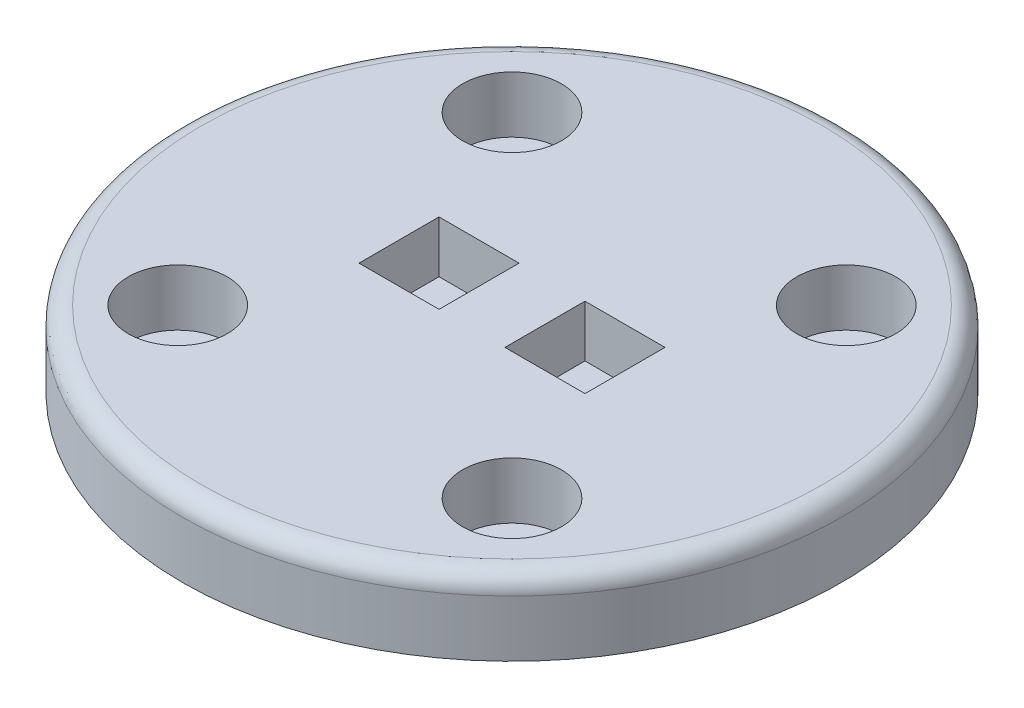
ISO-10303-21;
HEADER;
FILE_DESCRIPTION(('STEP AP214'),'2;1');
FILE_NAME('part.step','',(''),(''),'','','');
FILE_SCHEMA(('AUTOMOTIVE_DESIGN { 1 0 10303 214 1 1 1 1 }'));
ENDSEC;
DATA;
#1=APPLICATION_CONTEXT('core data for automotive mechanical design processes');
#2=APPLICATION_PROTOCOL_DEFINITION('international standard','automotive_design',2000,#1);
#3=PRODUCT_CONTEXT('',#1,'mechanical');
#4=PRODUCT('Part','Part','',(#3));
#5=PRODUCT_RELATED_PRODUCT_CATEGORY('part','',(#4));
#6=PRODUCT_DEFINITION_FORMATION('','',#4);
#7=PRODUCT_DEFINITION_CONTEXT('part definition',#1,'design');
#8=PRODUCT_DEFINITION('design','',#6,#7);
#9=PRODUCT_DEFINITION_SHAPE('','',#8);
#10=(LENGTH_UNIT() NAMED_UNIT(*) SI_UNIT(.MILLI.,.METRE.));
#11=(NAMED_UNIT(*) PLANE_ANGLE_UNIT() SI_UNIT($,.RADIAN.));
#12=(NAMED_UNIT(*) SI_UNIT($,.STERADIAN.) SOLID_ANGLE_UNIT());
#13=UNCERTAINTY_MEASURE_WITH_UNIT(LENGTH_MEASURE(1.E-05),#10,'distance_accuracy_value','');
#14=(GEOMETRIC_REPRESENTATION_CONTEXT(3) GLOBAL_UNCERTAINTY_ASSIGNED_CONTEXT((#13)) GLOBAL_UNIT_ASSIGNED_CONTEXT((#10,
#11,#12)) REPRESENTATION_CONTEXT('',''));
#15=CARTESIAN_POINT('',(0.,0.,0.));
#16=DIRECTION('',(0.,0.,1.));
#17=DIRECTION('',(1.,0.,0.));
#18=AXIS2_PLACEMENT_3D('',#15,#16,#17);
#19=CARTESIAN_POINT('',(0.,8.,0.));
#20=DIRECTION('',(0.,-1.,0.));
#21=DIRECTION('',(0.,0.,-1.));
#22=AXIS2_PLACEMENT_3D('',#19,#20,#21);
#23=CYLINDRICAL_SURFACE('',#22,35.);
#24=CARTESIAN_POINT('',(0.,6.,0.));
#25=DIRECTION('',(0.,1.,0.));
#26=DIRECTION('',(0.,0.,1.));
#27=AXIS2_PLACEMENT_3D('',#24,#25,#26);
#28=CIRCLE('',#27,35.);
#29=CARTESIAN_POINT('',(0.,6.,35.));
#30=VERTEX_POINT('',#29);
#31=EDGE_CURVE('E11',#30,#30,#28,.F.);
#32=ORIENTED_EDGE('',*,*,#31,.T.);
#33=EDGE_LOOP('',(#32));
#34=FACE_BOUND('',#33,.T.);
#35=CARTESIAN_POINT('',(0.,0.,0.));
#36=DIRECTION('',(0.,1.,0.));
#37=DIRECTION('',(0.,0.,1.));
#38=AXIS2_PLACEMENT_3D('',#35,#36,#37);
#39=CIRCLE('',#38,35.);
#40=CARTESIAN_POINT('',(0.,0.,35.));
#41=VERTEX_POINT('',#40);
#42=EDGE_CURVE('E214',#41,#41,#39,.T.);
#43=ORIENTED_EDGE('',*,*,#42,.T.);
#44=EDGE_LOOP('',(#43));
#45=FACE_BOUND('',#44,.T.);
#46=ADVANCED_FACE('F35',(#34,#45),#23,.T.);
#47=CARTESIAN_POINT('',(0.,8.,0.));
#48=DIRECTION('',(0.,1.,0.));
#49=DIRECTION('',(0.,0.,1.));
#50=AXIS2_PLACEMENT_3D('',#47,#48,#49);
#51=PLANE('',#50);
#52=CARTESIAN_POINT('',(0.,8.,0.));
#53=DIRECTION('',(0.,1.,0.));
#54=DIRECTION('',(0.,0.,1.));
#55=AXIS2_PLACEMENT_3D('',#52,#53,#54);
#56=CIRCLE('',#55,33.);
#57=CARTESIAN_POINT('',(0.,8.,33.));
#58=VERTEX_POINT('',#57);
#59=EDGE_CURVE('E43',#58,#58,#56,.T.);
#60=ORIENTED_EDGE('',*,*,#59,.T.);
#61=EDGE_LOOP('',(#60));
#62=FACE_BOUND('',#61,.T.);
#63=DIRECTION('',(-1.,0.,0.));
#64=VECTOR('',#63,1.);
#65=CARTESIAN_POINT('',(12.,8.,-4.25));
#66=LINE('',#65,#64);
#67=CARTESIAN_POINT('',(12.,8.,-4.25));
#68=VERTEX_POINT('',#67);
#69=CARTESIAN_POINT('',(3.5,8.,-4.25));
#70=VERTEX_POINT('',#69);
#71=EDGE_CURVE('E50',#68,#70,#66,.T.);
#72=ORIENTED_EDGE('',*,*,#71,.F.);
#73=DIRECTION('',(0.,0.,-1.));
#74=VECTOR('',#73,1.);
#75=CARTESIAN_POINT('',(12.,8.,-4.25));
#76=LINE('',#75,#74);
#77=CARTESIAN_POINT('',(12.,8.,4.25));
#78=VERTEX_POINT('',#77);
#79=EDGE_CURVE('E120',#78,#68,#76,.T.);
#80=ORIENTED_EDGE('',*,*,#79,.F.);
#81=DIRECTION('',(1.,0.,0.));
#82=VECTOR('',#81,1.);
#83=CARTESIAN_POINT('',(12.,8.,4.25));
#84=LINE('',#83,#82);
#85=CARTESIAN_POINT('',(3.5,8.,4.25));
#86=VERTEX_POINT('',#85);
#87=EDGE_CURVE('E123',#86,#78,#84,.T.);
#88=ORIENTED_EDGE('',*,*,#87,.F.);
#89=DIRECTION('',(0.,0.,1.));
#90=VECTOR('',#89,1.);
#91=CARTESIAN_POINT('',(3.5,8.,-4.25));
#92=LINE('',#91,#90);
#93=EDGE_CURVE('E129',#70,#86,#92,.T.);
#94=ORIENTED_EDGE('',*,*,#93,.F.);
#95=EDGE_LOOP('',(#72,#80,#88,#94));
#96=FACE_BOUND('',#95,.T.);
#97=DIRECTION('',(0.,0.,1.));
#98=VECTOR('',#97,1.);
#99=CARTESIAN_POINT('',(-12.,8.,-4.25));
#100=LINE('',#99,#98);
#101=CARTESIAN_POINT('',(-12.,8.,-4.25));
#102=VERTEX_POINT('',#101);
#103=CARTESIAN_POINT('',(-12.,8.,4.25));
#104=VERTEX_POINT('',#103);
#105=EDGE_CURVE('E58',#102,#104,#100,.T.);
#106=ORIENTED_EDGE('',*,*,#105,.F.);
#107=DIRECTION('',(-1.,0.,0.));
#108=VECTOR('',#107,1.);
#109=CARTESIAN_POINT('',(-12.,8.,-4.25));
#110=LINE('',#109,#108);
#111=CARTESIAN_POINT('',(-3.5,8.,-4.25));
#112=VERTEX_POINT('',#111);
#113=EDGE_CURVE('E142',#112,#102,#110,.T.);
#114=ORIENTED_EDGE('',*,*,#113,.F.);
#115=DIRECTION('',(0.,0.,-1.));
#116=VECTOR('',#115,1.);
#117=CARTESIAN_POINT('',(-3.5,8.,-4.25));
#118=LINE('',#117,#116);
#119=CARTESIAN_POINT('',(-3.5,8.,4.25));
#120=VERTEX_POINT('',#119);
#121=EDGE_CURVE('E156',#120,#112,#118,.T.);
#122=ORIENTED_EDGE('',*,*,#121,.F.);
#123=DIRECTION('',(1.,0.,0.));
#124=VECTOR('',#123,1.);
#125=CARTESIAN_POINT('',(-12.,8.,4.25));
#126=LINE('',#125,#124);
#127=EDGE_CURVE('E153',#104,#120,#126,.T.);
#128=ORIENTED_EDGE('',*,*,#127,.F.);
#129=EDGE_LOOP('',(#106,#114,#122,#128));
#130=FACE_BOUND('',#129,.T.);
#131=CARTESIAN_POINT('',(-17.75,8.,17.75));
#132=DIRECTION('',(0.,1.,0.));
#133=DIRECTION('',(0.,0.,1.));
#134=AXIS2_PLACEMENT_3D('',#131,#132,#133);
#135=CIRCLE('',#134,5.25);
#136=CARTESIAN_POINT('',(-17.75,8.,23.));
#137=VERTEX_POINT('',#136);
#138=EDGE_CURVE('E190',#137,#137,#135,.T.);
#139=ORIENTED_EDGE('',*,*,#138,.F.);
#140=EDGE_LOOP('',(#139));
#141=FACE_BOUND('',#140,.T.);
#142=CARTESIAN_POINT('',(17.75,8.,17.75));
#143=DIRECTION('',(0.,1.,0.));
#144=DIRECTION('',(0.,0.,1.));
#145=AXIS2_PLACEMENT_3D('',#142,#143,#144);
#146=CIRCLE('',#145,5.25);
#147=CARTESIAN_POINT('',(17.75,8.,23.));
#148=VERTEX_POINT('',#147);
#149=EDGE_CURVE('E196',#148,#148,#146,.T.);
#150=ORIENTED_EDGE('',*,*,#149,.F.);
#151=EDGE_LOOP('',(#150));
#152=FACE_BOUND('',#151,.T.);
#153=CARTESIAN_POINT('',(17.75,8.,-17.75));
#154=DIRECTION('',(0.,1.,0.));
#155=DIRECTION('',(0.,0.,1.));
#156=AXIS2_PLACEMENT_3D('',#153,#154,#155);
#157=CIRCLE('',#156,5.25);
#158=CARTESIAN_POINT('',(17.75,8.,-12.5));
#159=VERTEX_POINT('',#158);
#160=EDGE_CURVE('E202',#159,#159,#157,.T.);
#161=ORIENTED_EDGE('',*,*,#160,.F.);
#162=EDGE_LOOP('',(#161));
#163=FACE_BOUND('',#162,.T.);
#164=CARTESIAN_POINT('',(-17.75,8.,-17.75));
#165=DIRECTION('',(0.,1.,0.));
#166=DIRECTION('',(0.,0.,1.));
#167=AXIS2_PLACEMENT_3D('',#164,#165,#166);
#168=CIRCLE('',#167,5.25);
#169=CARTESIAN_POINT('',(-17.75,8.,-12.5));
#170=VERTEX_POINT('',#169);
#171=EDGE_CURVE('E208',#170,#170,#168,.T.);
#172=ORIENTED_EDGE('',*,*,#171,.F.);
#173=EDGE_LOOP('',(#172));
#174=FACE_BOUND('',#173,.T.);
#175=ADVANCED_FACE('F221',(#62,#96,#130,#141,#152,#163,#174),#51,.T.);
#176=CARTESIAN_POINT('',(0.,0.,0.));
#177=DIRECTION('',(0.,1.,0.));
#178=DIRECTION('',(0.,0.,1.));
#179=AXIS2_PLACEMENT_3D('',#176,#177,#178);
#180=PLANE('',#179);
#181=CARTESIAN_POINT('',(17.75,0.,17.75));
#182=DIRECTION('',(0.,1.,0.));
#183=DIRECTION('',(0.,0.,1.));
#184=AXIS2_PLACEMENT_3D('',#181,#182,#183);
#185=CIRCLE('',#184,3.25);
#186=CARTESIAN_POINT('',(17.75,0.,21.));
#187=VERTEX_POINT('',#186);
#188=EDGE_CURVE('E169',#187,#187,#185,.T.);
#189=ORIENTED_EDGE('',*,*,#188,.T.);
#190=EDGE_LOOP('',(#189));
#191=FACE_BOUND('',#190,.T.);
#192=CARTESIAN_POINT('',(-17.75,0.,17.75));
#193=DIRECTION('',(0.,1.,0.));
#194=DIRECTION('',(0.,0.,1.));
#195=AXIS2_PLACEMENT_3D('',#192,#193,#194);
#196=CIRCLE('',#195,3.25);
#197=CARTESIAN_POINT('',(-17.75,0.,21.));
#198=VERTEX_POINT('',#197);
#199=EDGE_CURVE('E175',#198,#198,#196,.T.);
#200=ORIENTED_EDGE('',*,*,#199,.T.);
#201=EDGE_LOOP('',(#200));
#202=FACE_BOUND('',#201,.T.);
#203=CARTESIAN_POINT('',(-17.75,0.,-17.75));
#204=DIRECTION('',(0.,1.,0.));
#205=DIRECTION('',(0.,0.,1.));
#206=AXIS2_PLACEMENT_3D('',#203,#204,#205);
#207=CIRCLE('',#206,3.25);
#208=CARTESIAN_POINT('',(-17.75,0.,-14.5));
#209=VERTEX_POINT('',#208);
#210=EDGE_CURVE('E181',#209,#209,#207,.T.);
#211=ORIENTED_EDGE('',*,*,#210,.T.);
#212=EDGE_LOOP('',(#211));
#213=FACE_BOUND('',#212,.T.);
#214=CARTESIAN_POINT('',(17.75,0.,-17.75));
#215=DIRECTION('',(0.,1.,0.));
#216=DIRECTION('',(0.,0.,1.));
#217=AXIS2_PLACEMENT_3D('',#214,#215,#216);
#218=CIRCLE('',#217,3.25);
#219=CARTESIAN_POINT('',(17.75,0.,-14.5));
#220=VERTEX_POINT('',#219);
#221=EDGE_CURVE('E187',#220,#220,#218,.T.);
#222=ORIENTED_EDGE('',*,*,#221,.T.);
#223=EDGE_LOOP('',(#222));
#224=FACE_BOUND('',#223,.T.);
#225=ORIENTED_EDGE('',*,*,#42,.F.);
#226=EDGE_LOOP('',(#225));
#227=FACE_BOUND('',#226,.T.);
#228=ADVANCED_FACE('F237',(#191,#202,#213,#224,#227),#180,.F.);
#229=CARTESIAN_POINT('',(-17.75,2.,-17.75));
#230=DIRECTION('',(0.,1.,0.));
#231=DIRECTION('',(0.,0.,1.));
#232=AXIS2_PLACEMENT_3D('',#229,#230,#231);
#233=CYLINDRICAL_SURFACE('',#232,5.25);
#234=CARTESIAN_POINT('',(-17.75,2.,-17.75));
#235=DIRECTION('',(0.,1.,0.));
#236=DIRECTION('',(0.,0.,1.));
#237=AXIS2_PLACEMENT_3D('',#234,#235,#236);
#238=CIRCLE('',#237,5.25);
#239=CARTESIAN_POINT('',(-17.75,2.,-12.5));
#240=VERTEX_POINT('',#239);
#241=EDGE_CURVE('E211',#240,#240,#238,.T.);
#242=ORIENTED_EDGE('',*,*,#241,.F.);
#243=EDGE_LOOP('',(#242));
#244=FACE_BOUND('',#243,.T.);
#245=ORIENTED_EDGE('',*,*,#171,.T.);
#246=EDGE_LOOP('',(#245));
#247=FACE_BOUND('',#246,.T.);
#248=ADVANCED_FACE('F242',(#244,#247),#233,.F.);
#249=CARTESIAN_POINT('',(-17.75,2.,-17.75));
#250=DIRECTION('',(0.,1.,0.));
#251=DIRECTION('',(0.,0.,1.));
#252=AXIS2_PLACEMENT_3D('',#249,#250,#251);
#253=PLANE('',#252);
#254=CARTESIAN_POINT('',(-17.75,2.,-17.75));
#255=DIRECTION('',(0.,1.,0.));
#256=DIRECTION('',(0.,0.,1.));
#257=AXIS2_PLACEMENT_3D('',#254,#255,#256);
#258=CIRCLE('',#257,3.25);
#259=CARTESIAN_POINT('',(-17.75,2.,-14.5));
#260=VERTEX_POINT('',#259);
#261=EDGE_CURVE('E178',#260,#260,#258,.T.);
#262=ORIENTED_EDGE('',*,*,#261,.F.);
#263=EDGE_LOOP('',(#262));
#264=FACE_BOUND('',#263,.T.);
#265=ORIENTED_EDGE('',*,*,#241,.T.);
#266=EDGE_LOOP('',(#265));
#267=FACE_BOUND('',#266,.T.);
#268=ADVANCED_FACE('F247',(#264,#267),#253,.T.);
#269=CARTESIAN_POINT('',(17.75,2.,-17.75));
#270=DIRECTION('',(0.,1.,0.));
#271=DIRECTION('',(0.,0.,1.));
#272=AXIS2_PLACEMENT_3D('',#269,#270,#271);
#273=CYLINDRICAL_SURFACE('',#272,5.25);
#274=CARTESIAN_POINT('',(17.75,2.,-17.75));
#275=DIRECTION('',(0.,1.,0.));
#276=DIRECTION('',(0.,0.,1.));
#277=AXIS2_PLACEMENT_3D('',#274,#275,#276);
#278=CIRCLE('',#277,5.25);
#279=CARTESIAN_POINT('',(17.75,2.,-12.5));
#280=VERTEX_POINT('',#279);
#281=EDGE_CURVE('E205',#280,#280,#278,.T.);
#282=ORIENTED_EDGE('',*,*,#281,.F.);
#283=EDGE_LOOP('',(#282));
#284=FACE_BOUND('',#283,.T.);
#285=ORIENTED_EDGE('',*,*,#160,.T.);
#286=EDGE_LOOP('',(#285));
#287=FACE_BOUND('',#286,.T.);
#288=ADVANCED_FACE('F251',(#284,#287),#273,.F.);
#289=CARTESIAN_POINT('',(17.75,2.,-17.75));
#290=DIRECTION('',(0.,1.,0.));
#291=DIRECTION('',(0.,0.,1.));
#292=AXIS2_PLACEMENT_3D('',#289,#290,#291);
#293=PLANE('',#292);
#294=CARTESIAN_POINT('',(17.75,2.,-17.75));
#295=DIRECTION('',(0.,1.,0.));
#296=DIRECTION('',(0.,0.,1.));
#297=AXIS2_PLACEMENT_3D('',#294,#295,#296);
#298=CIRCLE('',#297,3.25);
#299=CARTESIAN_POINT('',(17.75,2.,-14.5));
#300=VERTEX_POINT('',#299);
#301=EDGE_CURVE('E184',#300,#300,#298,.T.);
#302=ORIENTED_EDGE('',*,*,#301,.F.);
#303=EDGE_LOOP('',(#302));
#304=FACE_BOUND('',#303,.T.);
#305=ORIENTED_EDGE('',*,*,#281,.T.);
#306=EDGE_LOOP('',(#305));
#307=FACE_BOUND('',#306,.T.);
#308=ADVANCED_FACE('F255',(#304,#307),#293,.T.);
#309=CARTESIAN_POINT('',(17.75,2.,17.75));
#310=DIRECTION('',(0.,1.,0.));
#311=DIRECTION('',(0.,0.,1.));
#312=AXIS2_PLACEMENT_3D('',#309,#310,#311);
#313=CYLINDRICAL_SURFACE('',#312,5.25);
#314=CARTESIAN_POINT('',(17.75,2.,17.75));
#315=DIRECTION('',(0.,1.,0.));
#316=DIRECTION('',(0.,0.,1.));
#317=AXIS2_PLACEMENT_3D('',#314,#315,#316);
#318=CIRCLE('',#317,5.25);
#319=CARTESIAN_POINT('',(17.75,2.,23.));
#320=VERTEX_POINT('',#319);
#321=EDGE_CURVE('E199',#320,#320,#318,.T.);
#322=ORIENTED_EDGE('',*,*,#321,.F.);
#323=EDGE_LOOP('',(#322));
#324=FACE_BOUND('',#323,.T.);
#325=ORIENTED_EDGE('',*,*,#149,.T.);
#326=EDGE_LOOP('',(#325));
#327=FACE_BOUND('',#326,.T.);
#328=ADVANCED_FACE('F259',(#324,#327),#313,.F.);
#329=CARTESIAN_POINT('',(17.75,2.,17.75));
#330=DIRECTION('',(0.,1.,0.));
#331=DIRECTION('',(0.,0.,1.));
#332=AXIS2_PLACEMENT_3D('',#329,#330,#331);
#333=PLANE('',#332);
#334=CARTESIAN_POINT('',(17.75,2.,17.75));
#335=DIRECTION('',(0.,1.,0.));
#336=DIRECTION('',(0.,0.,1.));
#337=AXIS2_PLACEMENT_3D('',#334,#335,#336);
#338=CIRCLE('',#337,3.25);
#339=CARTESIAN_POINT('',(17.75,2.,21.));
#340=VERTEX_POINT('',#339);
#341=EDGE_CURVE('E163',#340,#340,#338,.T.);
#342=ORIENTED_EDGE('',*,*,#341,.F.);
#343=EDGE_LOOP('',(#342));
#344=FACE_BOUND('',#343,.T.);
#345=ORIENTED_EDGE('',*,*,#321,.T.);
#346=EDGE_LOOP('',(#345));
#347=FACE_BOUND('',#346,.T.);
#348=ADVANCED_FACE('F263',(#344,#347),#333,.T.);
#349=CARTESIAN_POINT('',(-17.75,2.,17.75));
#350=DIRECTION('',(0.,1.,0.));
#351=DIRECTION('',(0.,0.,1.));
#352=AXIS2_PLACEMENT_3D('',#349,#350,#351);
#353=CYLINDRICAL_SURFACE('',#352,5.25);
#354=CARTESIAN_POINT('',(-17.75,2.,17.75));
#355=DIRECTION('',(0.,1.,0.));
#356=DIRECTION('',(0.,0.,1.));
#357=AXIS2_PLACEMENT_3D('',#354,#355,#356);
#358=CIRCLE('',#357,5.25);
#359=CARTESIAN_POINT('',(-17.75,2.,23.));
#360=VERTEX_POINT('',#359);
#361=EDGE_CURVE('E193',#360,#360,#358,.T.);
#362=ORIENTED_EDGE('',*,*,#361,.F.);
#363=EDGE_LOOP('',(#362));
#364=FACE_BOUND('',#363,.T.);
#365=ORIENTED_EDGE('',*,*,#138,.T.);
#366=EDGE_LOOP('',(#365));
#367=FACE_BOUND('',#366,.T.);
#368=ADVANCED_FACE('F267',(#364,#367),#353,.F.);
#369=CARTESIAN_POINT('',(-17.75,2.,17.75));
#370=DIRECTION('',(0.,1.,0.));
#371=DIRECTION('',(0.,0.,1.));
#372=AXIS2_PLACEMENT_3D('',#369,#370,#371);
#373=PLANE('',#372);
#374=CARTESIAN_POINT('',(-17.75,2.,17.75));
#375=DIRECTION('',(0.,1.,0.));
#376=DIRECTION('',(0.,0.,1.));
#377=AXIS2_PLACEMENT_3D('',#374,#375,#376);
#378=CIRCLE('',#377,3.25);
#379=CARTESIAN_POINT('',(-17.75,2.,21.));
#380=VERTEX_POINT('',#379);
#381=EDGE_CURVE('E172',#380,#380,#378,.T.);
#382=ORIENTED_EDGE('',*,*,#381,.F.);
#383=EDGE_LOOP('',(#382));
#384=FACE_BOUND('',#383,.T.);
#385=ORIENTED_EDGE('',*,*,#361,.T.);
#386=EDGE_LOOP('',(#385));
#387=FACE_BOUND('',#386,.T.);
#388=ADVANCED_FACE('F271',(#384,#387),#373,.T.);
#389=CARTESIAN_POINT('',(17.75,0.,-17.75));
#390=DIRECTION('',(0.,1.,0.));
#391=DIRECTION('',(0.,0.,1.));
#392=AXIS2_PLACEMENT_3D('',#389,#390,#391);
#393=CYLINDRICAL_SURFACE('',#392,3.25);
#394=ORIENTED_EDGE('',*,*,#221,.F.);
#395=EDGE_LOOP('',(#394));
#396=FACE_BOUND('',#395,.T.);
#397=ORIENTED_EDGE('',*,*,#301,.T.);
#398=EDGE_LOOP('',(#397));
#399=FACE_BOUND('',#398,.T.);
#400=ADVANCED_FACE('F275',(#396,#399),#393,.F.);
#401=CARTESIAN_POINT('',(-17.75,0.,-17.75));
#402=DIRECTION('',(0.,1.,0.));
#403=DIRECTION('',(0.,0.,1.));
#404=AXIS2_PLACEMENT_3D('',#401,#402,#403);
#405=CYLINDRICAL_SURFACE('',#404,3.25);
#406=ORIENTED_EDGE('',*,*,#210,.F.);
#407=EDGE_LOOP('',(#406));
#408=FACE_BOUND('',#407,.T.);
#409=ORIENTED_EDGE('',*,*,#261,.T.);
#410=EDGE_LOOP('',(#409));
#411=FACE_BOUND('',#410,.T.);
#412=ADVANCED_FACE('F279',(#408,#411),#405,.F.);
#413=CARTESIAN_POINT('',(-17.75,0.,17.75));
#414=DIRECTION('',(0.,1.,0.));
#415=DIRECTION('',(0.,0.,1.));
#416=AXIS2_PLACEMENT_3D('',#413,#414,#415);
#417=CYLINDRICAL_SURFACE('',#416,3.25);
#418=ORIENTED_EDGE('',*,*,#199,.F.);
#419=EDGE_LOOP('',(#418));
#420=FACE_BOUND('',#419,.T.);
#421=ORIENTED_EDGE('',*,*,#381,.T.);
#422=EDGE_LOOP('',(#421));
#423=FACE_BOUND('',#422,.T.);
#424=ADVANCED_FACE('F283',(#420,#423),#417,.F.);
#425=CARTESIAN_POINT('',(17.75,0.,17.75));
#426=DIRECTION('',(0.,1.,0.));
#427=DIRECTION('',(0.,0.,1.));
#428=AXIS2_PLACEMENT_3D('',#425,#426,#427);
#429=CYLINDRICAL_SURFACE('',#428,3.25);
#430=ORIENTED_EDGE('',*,*,#188,.F.);
#431=EDGE_LOOP('',(#430));
#432=FACE_BOUND('',#431,.T.);
#433=ORIENTED_EDGE('',*,*,#341,.T.);
#434=EDGE_LOOP('',(#433));
#435=FACE_BOUND('',#434,.T.);
#436=ADVANCED_FACE('F287',(#432,#435),#429,.F.);
#437=CARTESIAN_POINT('',(-12.,2.5,-4.25));
#438=DIRECTION('',(-1.,0.,0.));
#439=DIRECTION('',(0.,0.,1.));
#440=AXIS2_PLACEMENT_3D('',#437,#438,#439);
#441=PLANE('',#440);
#442=ORIENTED_EDGE('',*,*,#105,.T.);
#443=DIRECTION('',(0.,1.,0.));
#444=VECTOR('',#443,1.);
#445=CARTESIAN_POINT('',(-12.,2.5,4.25));
#446=LINE('',#445,#444);
#447=CARTESIAN_POINT('',(-12.,2.5,4.25));
#448=VERTEX_POINT('',#447);
#449=EDGE_CURVE('E151',#448,#104,#446,.T.);
#450=ORIENTED_EDGE('',*,*,#449,.F.);
#451=DIRECTION('',(0.,0.,1.));
#452=VECTOR('',#451,1.);
#453=CARTESIAN_POINT('',(-12.,2.5,-4.25));
#454=LINE('',#453,#452);
#455=CARTESIAN_POINT('',(-12.,2.5,-4.25));
#456=VERTEX_POINT('',#455);
#457=EDGE_CURVE('E138',#456,#448,#454,.T.);
#458=ORIENTED_EDGE('',*,*,#457,.F.);
#459=DIRECTION('',(0.,1.,0.));
#460=VECTOR('',#459,1.);
#461=CARTESIAN_POINT('',(-12.,2.5,-4.25));
#462=LINE('',#461,#460);
#463=EDGE_CURVE('E161',#456,#102,#462,.T.);
#464=ORIENTED_EDGE('',*,*,#463,.T.);
#465=EDGE_LOOP('',(#442,#450,#458,#464));
#466=FACE_BOUND('',#465,.T.);
#467=ADVANCED_FACE('F291',(#466),#441,.F.);
#468=CARTESIAN_POINT('',(-12.,2.5,-4.25));
#469=DIRECTION('',(0.,0.,-1.));
#470=DIRECTION('',(-1.,0.,0.));
#471=AXIS2_PLACEMENT_3D('',#468,#469,#470);
#472=PLANE('',#471);
#473=ORIENTED_EDGE('',*,*,#113,.T.);
#474=ORIENTED_EDGE('',*,*,#463,.F.);
#475=DIRECTION('',(-1.,0.,0.));
#476=VECTOR('',#475,1.);
#477=CARTESIAN_POINT('',(-12.,2.5,-4.25));
#478=LINE('',#477,#476);
#479=CARTESIAN_POINT('',(-3.5,2.5,-4.25));
#480=VERTEX_POINT('',#479);
#481=EDGE_CURVE('E148',#480,#456,#478,.T.);
#482=ORIENTED_EDGE('',*,*,#481,.F.);
#483=DIRECTION('',(0.,1.,0.));
#484=VECTOR('',#483,1.);
#485=CARTESIAN_POINT('',(-3.5,2.5,-4.25));
#486=LINE('',#485,#484);
#487=EDGE_CURVE('E164',#480,#112,#486,.T.);
#488=ORIENTED_EDGE('',*,*,#487,.T.);
#489=EDGE_LOOP('',(#473,#474,#482,#488));
#490=FACE_BOUND('',#489,.T.);
#491=ADVANCED_FACE('F295',(#490),#472,.F.);
#492=CARTESIAN_POINT('',(-3.5,2.5,-4.25));
#493=DIRECTION('',(1.,0.,0.));
#494=DIRECTION('',(0.,0.,-1.));
#495=AXIS2_PLACEMENT_3D('',#492,#493,#494);
#496=PLANE('',#495);
#497=ORIENTED_EDGE('',*,*,#121,.T.);
#498=ORIENTED_EDGE('',*,*,#487,.F.);
#499=DIRECTION('',(0.,0.,-1.));
#500=VECTOR('',#499,1.);
#501=CARTESIAN_POINT('',(-3.5,2.5,-4.25));
#502=LINE('',#501,#500);
#503=CARTESIAN_POINT('',(-3.5,2.5,4.25));
#504=VERTEX_POINT('',#503);
#505=EDGE_CURVE('E145',#504,#480,#502,.T.);
#506=ORIENTED_EDGE('',*,*,#505,.F.);
#507=DIRECTION('',(0.,1.,0.));
#508=VECTOR('',#507,1.);
#509=CARTESIAN_POINT('',(-3.5,2.5,4.25));
#510=LINE('',#509,#508);
#511=EDGE_CURVE('E166',#504,#120,#510,.T.);
#512=ORIENTED_EDGE('',*,*,#511,.T.);
#513=EDGE_LOOP('',(#497,#498,#506,#512));
#514=FACE_BOUND('',#513,.T.);
#515=ADVANCED_FACE('F300',(#514),#496,.F.);
#516=CARTESIAN_POINT('',(-12.,2.5,4.25));
#517=DIRECTION('',(0.,0.,1.));
#518=DIRECTION('',(1.,0.,0.));
#519=AXIS2_PLACEMENT_3D('',#516,#517,#518);
#520=PLANE('',#519);
#521=ORIENTED_EDGE('',*,*,#127,.T.);
#522=ORIENTED_EDGE('',*,*,#511,.F.);
#523=DIRECTION('',(1.,0.,0.));
#524=VECTOR('',#523,1.);
#525=CARTESIAN_POINT('',(-12.,2.5,4.25));
#526=LINE('',#525,#524);
#527=EDGE_CURVE('E141',#448,#504,#526,.T.);
#528=ORIENTED_EDGE('',*,*,#527,.F.);
#529=ORIENTED_EDGE('',*,*,#449,.T.);
#530=EDGE_LOOP('',(#521,#522,#528,#529));
#531=FACE_BOUND('',#530,.T.);
#532=ADVANCED_FACE('F296',(#531),#520,.F.);
#533=CARTESIAN_POINT('',(0.,2.5,0.));
#534=DIRECTION('',(0.,1.,0.));
#535=DIRECTION('',(0.,0.,1.));
#536=AXIS2_PLACEMENT_3D('',#533,#534,#535);
#537=PLANE('',#536);
#538=ORIENTED_EDGE('',*,*,#457,.T.);
#539=ORIENTED_EDGE('',*,*,#527,.T.);
#540=ORIENTED_EDGE('',*,*,#505,.T.);
#541=ORIENTED_EDGE('',*,*,#481,.T.);
#542=EDGE_LOOP('',(#538,#539,#540,#541));
#543=FACE_BOUND('',#542,.T.);
#544=ADVANCED_FACE('F299',(#543),#537,.T.);
#545=CARTESIAN_POINT('',(12.,2.5,-4.25));
#546=DIRECTION('',(0.,0.,-1.));
#547=DIRECTION('',(-1.,0.,0.));
#548=AXIS2_PLACEMENT_3D('',#545,#546,#547);
#549=PLANE('',#548);
#550=ORIENTED_EDGE('',*,*,#71,.T.);
#551=DIRECTION('',(0.,1.,0.));
#552=VECTOR('',#551,1.);
#553=CARTESIAN_POINT('',(3.5,2.5,-4.25));
#554=LINE('',#553,#552);
#555=CARTESIAN_POINT('',(3.5,2.5,-4.25));
#556=VERTEX_POINT('',#555);
#557=EDGE_CURVE('E98',#556,#70,#554,.T.);
#558=ORIENTED_EDGE('',*,*,#557,.F.);
#559=DIRECTION('',(-1.,0.,0.));
#560=VECTOR('',#559,1.);
#561=CARTESIAN_POINT('',(12.,2.5,-4.25));
#562=LINE('',#561,#560);
#563=CARTESIAN_POINT('',(12.,2.5,-4.25));
#564=VERTEX_POINT('',#563);
#565=EDGE_CURVE('E102',#564,#556,#562,.T.);
#566=ORIENTED_EDGE('',*,*,#565,.F.);
#567=DIRECTION('',(0.,1.,0.));
#568=VECTOR('',#567,1.);
#569=CARTESIAN_POINT('',(12.,2.5,-4.25));
#570=LINE('',#569,#568);
#571=EDGE_CURVE('E133',#564,#68,#570,.T.);
#572=ORIENTED_EDGE('',*,*,#571,.T.);
#573=EDGE_LOOP('',(#550,#558,#566,#572));
#574=FACE_BOUND('',#573,.T.);
#575=ADVANCED_FACE('F100',(#574),#549,.F.);
#576=CARTESIAN_POINT('',(12.,2.5,-4.25));
#577=DIRECTION('',(1.,0.,0.));
#578=DIRECTION('',(0.,0.,-1.));
#579=AXIS2_PLACEMENT_3D('',#576,#577,#578);
#580=PLANE('',#579);
#581=ORIENTED_EDGE('',*,*,#79,.T.);
#582=ORIENTED_EDGE('',*,*,#571,.F.);
#583=DIRECTION('',(0.,0.,-1.));
#584=VECTOR('',#583,1.);
#585=CARTESIAN_POINT('',(12.,2.5,-4.25));
#586=LINE('',#585,#584);
#587=CARTESIAN_POINT('',(12.,2.5,4.25));
#588=VERTEX_POINT('',#587);
#589=EDGE_CURVE('E108',#588,#564,#586,.T.);
#590=ORIENTED_EDGE('',*,*,#589,.F.);
#591=DIRECTION('',(0.,1.,0.));
#592=VECTOR('',#591,1.);
#593=CARTESIAN_POINT('',(12.,2.5,4.25));
#594=LINE('',#593,#592);
#595=EDGE_CURVE('E135',#588,#78,#594,.T.);
#596=ORIENTED_EDGE('',*,*,#595,.T.);
#597=EDGE_LOOP('',(#581,#582,#590,#596));
#598=FACE_BOUND('',#597,.T.);
#599=ADVANCED_FACE('F313',(#598),#580,.F.);
#600=CARTESIAN_POINT('',(12.,2.5,4.25));
#601=DIRECTION('',(0.,0.,1.));
#602=DIRECTION('',(1.,0.,0.));
#603=AXIS2_PLACEMENT_3D('',#600,#601,#602);
#604=PLANE('',#603);
#605=ORIENTED_EDGE('',*,*,#87,.T.);
#606=ORIENTED_EDGE('',*,*,#595,.F.);
#607=DIRECTION('',(1.,0.,0.));
#608=VECTOR('',#607,1.);
#609=CARTESIAN_POINT('',(12.,2.5,4.25));
#610=LINE('',#609,#608);
#611=CARTESIAN_POINT('',(3.5,2.5,4.25));
#612=VERTEX_POINT('',#611);
#613=EDGE_CURVE('E116',#612,#588,#610,.T.);
#614=ORIENTED_EDGE('',*,*,#613,.F.);
#615=DIRECTION('',(0.,1.,0.));
#616=VECTOR('',#615,1.);
#617=CARTESIAN_POINT('',(3.5,2.5,4.25));
#618=LINE('',#617,#616);
#619=EDGE_CURVE('E107',#612,#86,#618,.T.);
#620=ORIENTED_EDGE('',*,*,#619,.T.);
#621=EDGE_LOOP('',(#605,#606,#614,#620));
#622=FACE_BOUND('',#621,.T.);
#623=ADVANCED_FACE('F316',(#622),#604,.F.);
#624=CARTESIAN_POINT('',(3.5,2.5,-4.25));
#625=DIRECTION('',(-1.,0.,0.));
#626=DIRECTION('',(0.,0.,1.));
#627=AXIS2_PLACEMENT_3D('',#624,#625,#626);
#628=PLANE('',#627);
#629=ORIENTED_EDGE('',*,*,#93,.T.);
#630=ORIENTED_EDGE('',*,*,#619,.F.);
#631=DIRECTION('',(0.,0.,1.));
#632=VECTOR('',#631,1.);
#633=CARTESIAN_POINT('',(3.5,2.5,-4.25));
#634=LINE('',#633,#632);
#635=EDGE_CURVE('E111',#556,#612,#634,.T.);
#636=ORIENTED_EDGE('',*,*,#635,.F.);
#637=ORIENTED_EDGE('',*,*,#557,.T.);
#638=EDGE_LOOP('',(#629,#630,#636,#637));
#639=FACE_BOUND('',#638,.T.);
#640=ADVANCED_FACE('F112',(#639),#628,.F.);
#641=CARTESIAN_POINT('',(0.,2.5,0.));
#642=DIRECTION('',(0.,1.,0.));
#643=DIRECTION('',(0.,0.,1.));
#644=AXIS2_PLACEMENT_3D('',#641,#642,#643);
#645=PLANE('',#644);
#646=ORIENTED_EDGE('',*,*,#565,.T.);
#647=ORIENTED_EDGE('',*,*,#635,.T.);
#648=ORIENTED_EDGE('',*,*,#613,.T.);
#649=ORIENTED_EDGE('',*,*,#589,.T.);
#650=EDGE_LOOP('',(#646,#647,#648,#649));
#651=FACE_BOUND('',#650,.T.);
#652=ADVANCED_FACE('F118',(#651),#645,.T.);
#653=CARTESIAN_POINT('',(0.,6.,0.));
#654=DIRECTION('',(0.,1.,0.));
#655=DIRECTION('',(0.,0.,1.));
#656=AXIS2_PLACEMENT_3D('',#653,#654,#655);
#657=TOROIDAL_SURFACE('',#656,33.,2.);
#658=ORIENTED_EDGE('',*,*,#31,.F.);
#659=EDGE_LOOP('',(#658));
#660=FACE_BOUND('',#659,.T.);
#661=ORIENTED_EDGE('',*,*,#59,.F.);
#662=EDGE_LOOP('',(#661));
#663=FACE_BOUND('',#662,.T.);
#664=ADVANCED_FACE('F37',(#660,#663),#657,.T.);
#665=CLOSED_SHELL('',(#46,#175,#228,#248,#268,#288,#308,#328,#348,#368,#388,#400,#412,#424,#436,
#467,#491,#515,#532,#544,#575,#599,#623,#640,#652,#664));
#666=MANIFOLD_SOLID_BREP('B2',#665);
#667=ADVANCED_BREP_SHAPE_REPRESENTATION('',(#18,#666),#14);
#668=SHAPE_DEFINITION_REPRESENTATION(#9,#667);
ENDSEC;
END-ISO-10303-21;
